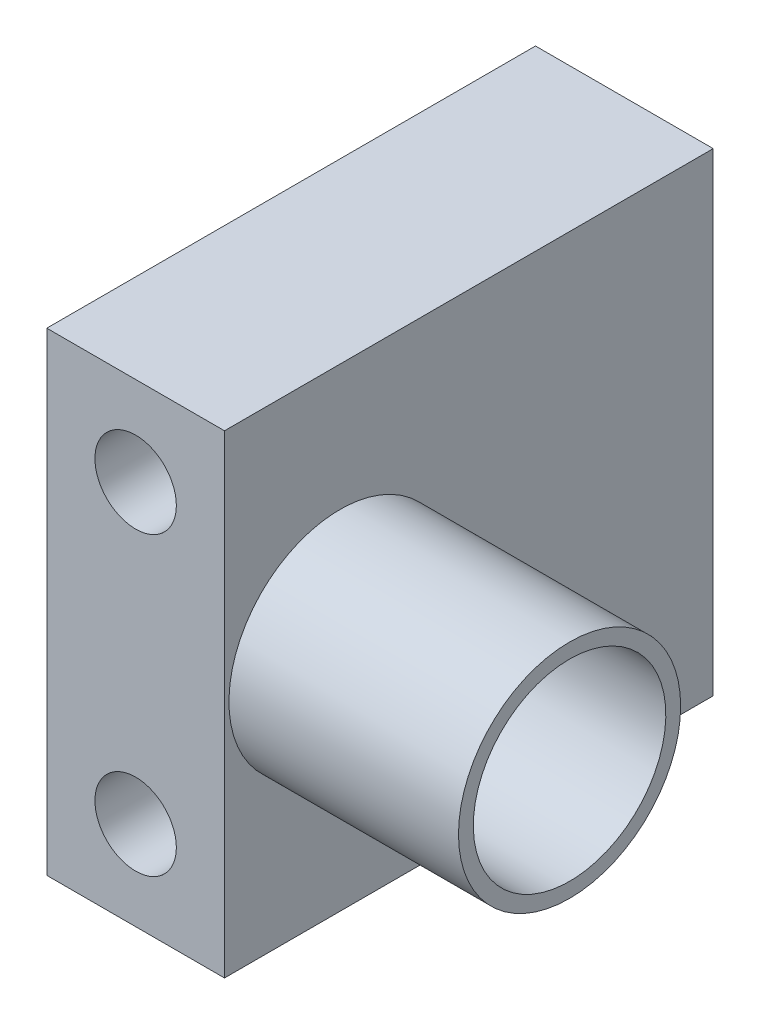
ISO-10303-21;
HEADER;
FILE_DESCRIPTION(('STEP AP214'),'2;1');
FILE_NAME('part.step','',(''),(''),'','','');
FILE_SCHEMA(('AUTOMOTIVE_DESIGN { 1 0 10303 214 1 1 1 1 }'));
ENDSEC;
DATA;
#1=APPLICATION_CONTEXT('core data for automotive mechanical design processes');
#2=APPLICATION_PROTOCOL_DEFINITION('international standard','automotive_design',2000,#1);
#3=PRODUCT_CONTEXT('',#1,'mechanical');
#4=PRODUCT('Part','Part','',(#3));
#5=PRODUCT_RELATED_PRODUCT_CATEGORY('part','',(#4));
#6=PRODUCT_DEFINITION_FORMATION('','',#4);
#7=PRODUCT_DEFINITION_CONTEXT('part definition',#1,'design');
#8=PRODUCT_DEFINITION('design','',#6,#7);
#9=PRODUCT_DEFINITION_SHAPE('','',#8);
#10=(LENGTH_UNIT() NAMED_UNIT(*) SI_UNIT(.MILLI.,.METRE.));
#11=(NAMED_UNIT(*) PLANE_ANGLE_UNIT() SI_UNIT($,.RADIAN.));
#12=(NAMED_UNIT(*) SI_UNIT($,.STERADIAN.) SOLID_ANGLE_UNIT());
#13=UNCERTAINTY_MEASURE_WITH_UNIT(LENGTH_MEASURE(1.E-05),#10,'distance_accuracy_value','');
#14=(GEOMETRIC_REPRESENTATION_CONTEXT(3) GLOBAL_UNCERTAINTY_ASSIGNED_CONTEXT((#13)) GLOBAL_UNIT_ASSIGNED_CONTEXT((#10,
#11,#12)) REPRESENTATION_CONTEXT('',''));
#15=CARTESIAN_POINT('',(0.,0.,0.));
#16=DIRECTION('',(0.,0.,1.));
#17=DIRECTION('',(1.,0.,0.));
#18=AXIS2_PLACEMENT_3D('',#15,#16,#17);
#19=CARTESIAN_POINT('',(6.,26.,33.));
#20=DIRECTION('',(-1.,0.,0.));
#21=DIRECTION('',(0.,-1.,0.));
#22=AXIS2_PLACEMENT_3D('',#19,#20,#21);
#23=PLANE('',#22);
#24=DIRECTION('',(0.,1.,0.));
#25=VECTOR('',#24,1.);
#26=CARTESIAN_POINT('',(6.,26.,0.));
#27=LINE('',#26,#25);
#28=CARTESIAN_POINT('',(6.,-6.,0.));
#29=VERTEX_POINT('',#28);
#30=CARTESIAN_POINT('',(6.,26.,0.));
#31=VERTEX_POINT('',#30);
#32=EDGE_CURVE('E62',#29,#31,#27,.T.);
#33=ORIENTED_EDGE('',*,*,#32,.T.);
#34=DIRECTION('',(0.,0.,-1.));
#35=VECTOR('',#34,1.);
#36=CARTESIAN_POINT('',(6.,26.,33.));
#37=LINE('',#36,#35);
#38=CARTESIAN_POINT('',(6.,26.,33.));
#39=VERTEX_POINT('',#38);
#40=EDGE_CURVE('E23',#39,#31,#37,.T.);
#41=ORIENTED_EDGE('',*,*,#40,.F.);
#42=DIRECTION('',(0.,1.,0.));
#43=VECTOR('',#42,1.);
#44=CARTESIAN_POINT('',(6.,26.,33.));
#45=LINE('',#44,#43);
#46=CARTESIAN_POINT('',(6.,-6.,33.));
#47=VERTEX_POINT('',#46);
#48=EDGE_CURVE('E88',#47,#39,#45,.T.);
#49=ORIENTED_EDGE('',*,*,#48,.F.);
#50=DIRECTION('',(0.,0.,-1.));
#51=VECTOR('',#50,1.);
#52=CARTESIAN_POINT('',(6.,-6.,33.));
#53=LINE('',#52,#51);
#54=EDGE_CURVE('E77',#47,#29,#53,.T.);
#55=ORIENTED_EDGE('',*,*,#54,.T.);
#56=EDGE_LOOP('',(#33,#41,#49,#55));
#57=FACE_BOUND('',#56,.T.);
#58=CARTESIAN_POINT('',(6.,10.,25.2));
#59=DIRECTION('',(-1.,0.,0.));
#60=DIRECTION('',(0.,-1.,0.));
#61=AXIS2_PLACEMENT_3D('',#58,#59,#60);
#62=CIRCLE('',#61,7.5);
#63=CARTESIAN_POINT('',(6.,2.5,25.2));
#64=VERTEX_POINT('',#63);
#65=EDGE_CURVE('E10',#64,#64,#62,.F.);
#66=ORIENTED_EDGE('',*,*,#65,.F.);
#67=EDGE_LOOP('',(#66));
#68=FACE_BOUND('',#67,.T.);
#69=ADVANCED_FACE('F15',(#57,#68),#23,.F.);
#70=CARTESIAN_POINT('',(6.,26.,33.));
#71=DIRECTION('',(0.,0.,-1.));
#72=DIRECTION('',(-1.,0.,0.));
#73=AXIS2_PLACEMENT_3D('',#70,#71,#72);
#74=PLANE('',#73);
#75=CARTESIAN_POINT('',(0.,20.,33.));
#76=DIRECTION('',(0.,0.,1.));
#77=DIRECTION('',(1.,0.,0.));
#78=AXIS2_PLACEMENT_3D('',#75,#76,#77);
#79=CIRCLE('',#78,2.75);
#80=CARTESIAN_POINT('',(2.75,20.,33.));
#81=VERTEX_POINT('',#80);
#82=EDGE_CURVE('E78',#81,#81,#79,.T.);
#83=ORIENTED_EDGE('',*,*,#82,.F.);
#84=EDGE_LOOP('',(#83));
#85=FACE_BOUND('',#84,.T.);
#86=ORIENTED_EDGE('',*,*,#48,.T.);
#87=DIRECTION('',(-1.,0.,0.));
#88=VECTOR('',#87,1.);
#89=CARTESIAN_POINT('',(6.,26.,33.));
#90=LINE('',#89,#88);
#91=CARTESIAN_POINT('',(-6.,26.,33.));
#92=VERTEX_POINT('',#91);
#93=EDGE_CURVE('E70',#39,#92,#90,.T.);
#94=ORIENTED_EDGE('',*,*,#93,.T.);
#95=DIRECTION('',(0.,-1.,0.));
#96=VECTOR('',#95,1.);
#97=CARTESIAN_POINT('',(-6.,26.,33.));
#98=LINE('',#97,#96);
#99=CARTESIAN_POINT('',(-6.,-6.,33.));
#100=VERTEX_POINT('',#99);
#101=EDGE_CURVE('E35',#92,#100,#98,.T.);
#102=ORIENTED_EDGE('',*,*,#101,.T.);
#103=DIRECTION('',(1.,0.,0.));
#104=VECTOR('',#103,1.);
#105=CARTESIAN_POINT('',(6.,-6.,33.));
#106=LINE('',#105,#104);
#107=EDGE_CURVE('E30',#100,#47,#106,.T.);
#108=ORIENTED_EDGE('',*,*,#107,.T.);
#109=EDGE_LOOP('',(#86,#94,#102,#108));
#110=FACE_BOUND('',#109,.T.);
#111=CARTESIAN_POINT('',(0.,0.,33.));
#112=DIRECTION('',(0.,0.,1.));
#113=DIRECTION('',(1.,0.,0.));
#114=AXIS2_PLACEMENT_3D('',#111,#112,#113);
#115=CIRCLE('',#114,2.75);
#116=CARTESIAN_POINT('',(2.75,0.,33.));
#117=VERTEX_POINT('',#116);
#118=EDGE_CURVE('E108',#117,#117,#115,.T.);
#119=ORIENTED_EDGE('',*,*,#118,.F.);
#120=EDGE_LOOP('',(#119));
#121=FACE_BOUND('',#120,.T.);
#122=ADVANCED_FACE('F101',(#85,#110,#121),#74,.F.);
#123=CARTESIAN_POINT('',(6.,26.,0.));
#124=DIRECTION('',(0.,0.,-1.));
#125=DIRECTION('',(-1.,0.,0.));
#126=AXIS2_PLACEMENT_3D('',#123,#124,#125);
#127=PLANE('',#126);
#128=CARTESIAN_POINT('',(0.,20.,0.));
#129=DIRECTION('',(0.,0.,1.));
#130=DIRECTION('',(1.,0.,0.));
#131=AXIS2_PLACEMENT_3D('',#128,#129,#130);
#132=CIRCLE('',#131,2.75);
#133=CARTESIAN_POINT('',(2.75,20.,0.));
#134=VERTEX_POINT('',#133);
#135=EDGE_CURVE('E81',#134,#134,#132,.T.);
#136=ORIENTED_EDGE('',*,*,#135,.T.);
#137=EDGE_LOOP('',(#136));
#138=FACE_BOUND('',#137,.T.);
#139=ORIENTED_EDGE('',*,*,#32,.F.);
#140=DIRECTION('',(1.,0.,0.));
#141=VECTOR('',#140,1.);
#142=CARTESIAN_POINT('',(6.,-6.,0.));
#143=LINE('',#142,#141);
#144=CARTESIAN_POINT('',(-6.,-6.,0.));
#145=VERTEX_POINT('',#144);
#146=EDGE_CURVE('E86',#145,#29,#143,.T.);
#147=ORIENTED_EDGE('',*,*,#146,.F.);
#148=DIRECTION('',(0.,-1.,0.));
#149=VECTOR('',#148,1.);
#150=CARTESIAN_POINT('',(-6.,26.,0.));
#151=LINE('',#150,#149);
#152=CARTESIAN_POINT('',(-6.,26.,0.));
#153=VERTEX_POINT('',#152);
#154=EDGE_CURVE('E63',#153,#145,#151,.T.);
#155=ORIENTED_EDGE('',*,*,#154,.F.);
#156=DIRECTION('',(-1.,0.,0.));
#157=VECTOR('',#156,1.);
#158=CARTESIAN_POINT('',(6.,26.,0.));
#159=LINE('',#158,#157);
#160=EDGE_CURVE('E56',#31,#153,#159,.T.);
#161=ORIENTED_EDGE('',*,*,#160,.F.);
#162=EDGE_LOOP('',(#139,#147,#155,#161));
#163=FACE_BOUND('',#162,.T.);
#164=CARTESIAN_POINT('',(0.,0.,0.));
#165=DIRECTION('',(0.,0.,1.));
#166=DIRECTION('',(1.,0.,0.));
#167=AXIS2_PLACEMENT_3D('',#164,#165,#166);
#168=CIRCLE('',#167,2.75);
#169=CARTESIAN_POINT('',(2.75,0.,0.));
#170=VERTEX_POINT('',#169);
#171=EDGE_CURVE('E110',#170,#170,#168,.T.);
#172=ORIENTED_EDGE('',*,*,#171,.T.);
#173=EDGE_LOOP('',(#172));
#174=FACE_BOUND('',#173,.T.);
#175=ADVANCED_FACE('F58',(#138,#163,#174),#127,.T.);
#176=CARTESIAN_POINT('',(6.,26.,33.));
#177=DIRECTION('',(0.,-1.,0.));
#178=DIRECTION('',(1.,0.,0.));
#179=AXIS2_PLACEMENT_3D('',#176,#177,#178);
#180=PLANE('',#179);
#181=ORIENTED_EDGE('',*,*,#160,.T.);
#182=DIRECTION('',(0.,0.,-1.));
#183=VECTOR('',#182,1.);
#184=CARTESIAN_POINT('',(-6.,26.,33.));
#185=LINE('',#184,#183);
#186=EDGE_CURVE('E73',#92,#153,#185,.T.);
#187=ORIENTED_EDGE('',*,*,#186,.F.);
#188=ORIENTED_EDGE('',*,*,#93,.F.);
#189=ORIENTED_EDGE('',*,*,#40,.T.);
#190=EDGE_LOOP('',(#181,#187,#188,#189));
#191=FACE_BOUND('',#190,.T.);
#192=ADVANCED_FACE('F69',(#191),#180,.F.);
#193=CARTESIAN_POINT('',(-6.,26.,33.));
#194=DIRECTION('',(1.,0.,0.));
#195=DIRECTION('',(0.,1.,0.));
#196=AXIS2_PLACEMENT_3D('',#193,#194,#195);
#197=PLANE('',#196);
#198=CARTESIAN_POINT('',(-6.,10.,25.2));
#199=DIRECTION('',(-1.,0.,0.));
#200=DIRECTION('',(0.,-1.,0.));
#201=AXIS2_PLACEMENT_3D('',#198,#199,#200);
#202=CIRCLE('',#201,4.25);
#203=CARTESIAN_POINT('',(-6.,5.75,25.2));
#204=VERTEX_POINT('',#203);
#205=EDGE_CURVE('E119',#204,#204,#202,.T.);
#206=ORIENTED_EDGE('',*,*,#205,.F.);
#207=EDGE_LOOP('',(#206));
#208=FACE_BOUND('',#207,.T.);
#209=ORIENTED_EDGE('',*,*,#154,.T.);
#210=DIRECTION('',(0.,0.,-1.));
#211=VECTOR('',#210,1.);
#212=CARTESIAN_POINT('',(-6.,-6.,33.));
#213=LINE('',#212,#211);
#214=EDGE_CURVE('E94',#100,#145,#213,.T.);
#215=ORIENTED_EDGE('',*,*,#214,.F.);
#216=ORIENTED_EDGE('',*,*,#101,.F.);
#217=ORIENTED_EDGE('',*,*,#186,.T.);
#218=EDGE_LOOP('',(#209,#215,#216,#217));
#219=FACE_BOUND('',#218,.T.);
#220=ADVANCED_FACE('F98',(#208,#219),#197,.F.);
#221=CARTESIAN_POINT('',(6.,-6.,33.));
#222=DIRECTION('',(0.,1.,0.));
#223=DIRECTION('',(-1.,0.,0.));
#224=AXIS2_PLACEMENT_3D('',#221,#222,#223);
#225=PLANE('',#224);
#226=ORIENTED_EDGE('',*,*,#146,.T.);
#227=ORIENTED_EDGE('',*,*,#54,.F.);
#228=ORIENTED_EDGE('',*,*,#107,.F.);
#229=ORIENTED_EDGE('',*,*,#214,.T.);
#230=EDGE_LOOP('',(#226,#227,#228,#229));
#231=FACE_BOUND('',#230,.T.);
#232=ADVANCED_FACE('F100',(#231),#225,.F.);
#233=CARTESIAN_POINT('',(0.,20.,33.));
#234=DIRECTION('',(0.,0.,-1.));
#235=DIRECTION('',(-1.,0.,0.));
#236=AXIS2_PLACEMENT_3D('',#233,#234,#235);
#237=CYLINDRICAL_SURFACE('',#236,2.75);
#238=ORIENTED_EDGE('',*,*,#82,.T.);
#239=EDGE_LOOP('',(#238));
#240=FACE_BOUND('',#239,.T.);
#241=ORIENTED_EDGE('',*,*,#135,.F.);
#242=EDGE_LOOP('',(#241));
#243=FACE_BOUND('',#242,.T.);
#244=ADVANCED_FACE('F189',(#240,#243),#237,.F.);
#245=CARTESIAN_POINT('',(0.,0.,33.));
#246=DIRECTION('',(0.,0.,-1.));
#247=DIRECTION('',(-1.,0.,0.));
#248=AXIS2_PLACEMENT_3D('',#245,#246,#247);
#249=CYLINDRICAL_SURFACE('',#248,2.75);
#250=ORIENTED_EDGE('',*,*,#118,.T.);
#251=EDGE_LOOP('',(#250));
#252=FACE_BOUND('',#251,.T.);
#253=ORIENTED_EDGE('',*,*,#171,.F.);
#254=EDGE_LOOP('',(#253));
#255=FACE_BOUND('',#254,.T.);
#256=ADVANCED_FACE('F142',(#252,#255),#249,.F.);
#257=CARTESIAN_POINT('',(21.5,10.,25.2));
#258=DIRECTION('',(-1.,0.,0.));
#259=DIRECTION('',(0.,-1.,0.));
#260=AXIS2_PLACEMENT_3D('',#257,#258,#259);
#261=CYLINDRICAL_SURFACE('',#260,7.5);
#262=CARTESIAN_POINT('',(21.5,10.,25.2));
#263=DIRECTION('',(1.,0.,0.));
#264=DIRECTION('',(0.,1.,0.));
#265=AXIS2_PLACEMENT_3D('',#262,#263,#264);
#266=CIRCLE('',#265,7.5);
#267=CARTESIAN_POINT('',(21.5,17.5,25.2));
#268=VERTEX_POINT('',#267);
#269=EDGE_CURVE('E114',#268,#268,#266,.T.);
#270=ORIENTED_EDGE('',*,*,#269,.F.);
#271=EDGE_LOOP('',(#270));
#272=FACE_BOUND('',#271,.T.);
#273=ORIENTED_EDGE('',*,*,#65,.T.);
#274=EDGE_LOOP('',(#273));
#275=FACE_BOUND('',#274,.T.);
#276=ADVANCED_FACE('F136',(#272,#275),#261,.T.);
#277=CARTESIAN_POINT('',(21.5,10.,25.2));
#278=DIRECTION('',(1.,0.,0.));
#279=DIRECTION('',(0.,1.,0.));
#280=AXIS2_PLACEMENT_3D('',#277,#278,#279);
#281=PLANE('',#280);
#282=CARTESIAN_POINT('',(21.5,10.,25.2));
#283=DIRECTION('',(1.,0.,0.));
#284=DIRECTION('',(0.,1.,0.));
#285=AXIS2_PLACEMENT_3D('',#282,#283,#284);
#286=CIRCLE('',#285,6.5);
#287=CARTESIAN_POINT('',(21.5,16.5,25.2));
#288=VERTEX_POINT('',#287);
#289=EDGE_CURVE('E125',#288,#288,#286,.T.);
#290=ORIENTED_EDGE('',*,*,#289,.F.);
#291=EDGE_LOOP('',(#290));
#292=FACE_BOUND('',#291,.T.);
#293=ORIENTED_EDGE('',*,*,#269,.T.);
#294=EDGE_LOOP('',(#293));
#295=FACE_BOUND('',#294,.T.);
#296=ADVANCED_FACE('F132',(#292,#295),#281,.T.);
#297=CARTESIAN_POINT('',(21.5,10.,25.2));
#298=DIRECTION('',(-1.,0.,0.));
#299=DIRECTION('',(0.,-1.,0.));
#300=AXIS2_PLACEMENT_3D('',#297,#298,#299);
#301=CYLINDRICAL_SURFACE('',#300,4.25);
#302=CARTESIAN_POINT('',(7.,10.,25.2));
#303=DIRECTION('',(-1.,0.,0.));
#304=DIRECTION('',(0.,-1.,0.));
#305=AXIS2_PLACEMENT_3D('',#302,#303,#304);
#306=CIRCLE('',#305,4.25);
#307=CARTESIAN_POINT('',(7.,5.75,25.2));
#308=VERTEX_POINT('',#307);
#309=EDGE_CURVE('E18',#308,#308,#306,.F.);
#310=ORIENTED_EDGE('',*,*,#309,.T.);
#311=EDGE_LOOP('',(#310));
#312=FACE_BOUND('',#311,.T.);
#313=ORIENTED_EDGE('',*,*,#205,.T.);
#314=EDGE_LOOP('',(#313));
#315=FACE_BOUND('',#314,.T.);
#316=ADVANCED_FACE('F135',(#312,#315),#301,.F.);
#317=CARTESIAN_POINT('',(7.,26.,33.));
#318=DIRECTION('',(-1.,0.,0.));
#319=DIRECTION('',(0.,-1.,0.));
#320=AXIS2_PLACEMENT_3D('',#317,#318,#319);
#321=PLANE('',#320);
#322=CARTESIAN_POINT('',(7.,10.,25.2));
#323=DIRECTION('',(-1.,0.,0.));
#324=DIRECTION('',(0.,-1.,0.));
#325=AXIS2_PLACEMENT_3D('',#322,#323,#324);
#326=CIRCLE('',#325,6.5);
#327=CARTESIAN_POINT('',(7.,3.5,25.2));
#328=VERTEX_POINT('',#327);
#329=EDGE_CURVE('E122',#328,#328,#326,.F.);
#330=ORIENTED_EDGE('',*,*,#329,.T.);
#331=EDGE_LOOP('',(#330));
#332=FACE_BOUND('',#331,.T.);
#333=ORIENTED_EDGE('',*,*,#309,.F.);
#334=EDGE_LOOP('',(#333));
#335=FACE_BOUND('',#334,.T.);
#336=ADVANCED_FACE('F220',(#332,#335),#321,.F.);
#337=CARTESIAN_POINT('',(-12.3847763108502,10.,25.2));
#338=DIRECTION('',(1.,0.,0.));
#339=DIRECTION('',(0.,1.,0.));
#340=AXIS2_PLACEMENT_3D('',#337,#338,#339);
#341=CYLINDRICAL_SURFACE('',#340,6.5);
#342=ORIENTED_EDGE('',*,*,#289,.T.);
#343=EDGE_LOOP('',(#342));
#344=FACE_BOUND('',#343,.T.);
#345=ORIENTED_EDGE('',*,*,#329,.F.);
#346=EDGE_LOOP('',(#345));
#347=FACE_BOUND('',#346,.T.);
#348=ADVANCED_FACE('F129',(#344,#347),#341,.F.);
#349=CLOSED_SHELL('',(#69,#122,#175,#192,#220,#232,#244,#256,#276,#296,#316,#336,#348));
#350=MANIFOLD_SOLID_BREP('B1',#349);
#351=ADVANCED_BREP_SHAPE_REPRESENTATION('',(#18,#350),#14);
#352=SHAPE_DEFINITION_REPRESENTATION(#9,#351);
ENDSEC;
END-ISO-10303-21;
